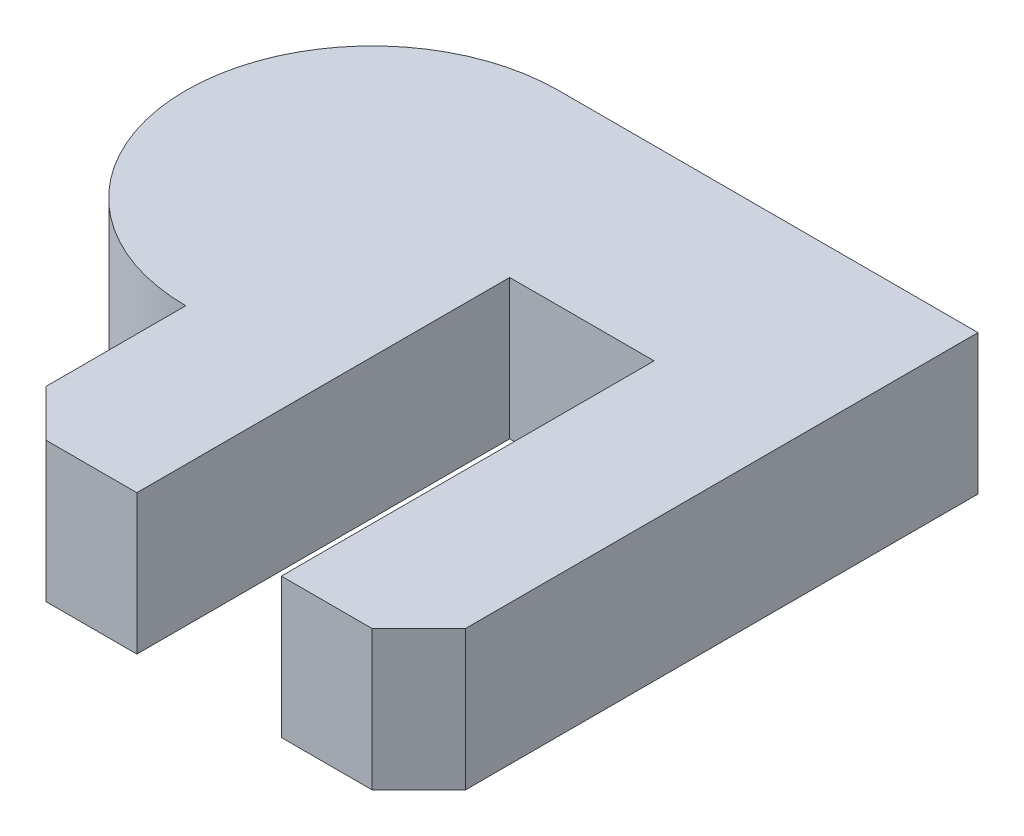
from build123d import *

# Parameters (mm, degrees)
SKETCH1_W           = 9
SKETCH1_H           = 12
BOSS_EXTRUDE1_DEPTH = 3
SKETCH2_W           = 3.1
SKETCH2_H           = 8
CUT_EXTRUDE1_DEPTH  = 3
BOSS_EXTRUDE2_DEPTH = 3
CUT_EXTRUDE2_DEPTH  = 10


with BuildPart() as part:
    # Sketch1 → Boss-Extrude1 (new body)
    with BuildSketch(Plane(origin=(0, 0, 0), x_dir=(1, 0, 0), z_dir=(0, 1, 0))):
        Rectangle(SKETCH1_W, SKETCH1_H)
    extrude(amount=BOSS_EXTRUDE1_DEPTH)

    # Sketch2 → Cut-Extrude1 (cut)
    with BuildSketch(Plane(origin=(0, 0, 0), x_dir=(1, 0, 0), z_dir=(0, 1, 0))):
        with Locations((0, -2)):
            Rectangle(SKETCH2_W, SKETCH2_H)
    extrude(amount=CUT_EXTRUDE1_DEPTH, mode=Mode.SUBTRACT)

    # Sketch3 → Boss-Extrude2 (add)
    with BuildSketch(Plane(origin=(0, 0, 0), x_dir=(1, 0, 0), z_dir=(0, 1, 0))):
        with BuildLine():
            Line((-4.5, 6), (-4.5, -2))
            ThreePointArc((-4.5, -2), (-8.5, 2), (-4.5, 6))
        make_face()
    extrude(amount=BOSS_EXTRUDE2_DEPTH)

    # Sketch4 → Cut-Extrude2 (cut)
    with BuildSketch(Plane(origin=(0, 0, 0), x_dir=(1, 0, 0), z_dir=(0, 1, 0))):
        Polygon((-4.5, -6), (-3.5, -6), (-4.5, -5), align=None)
        Polygon((4.5, -5), (4.5, -6), (3.5, -6), align=None)
    extrude(amount=CUT_EXTRUDE2_DEPTH, mode=Mode.SUBTRACT)


solid = part.part
